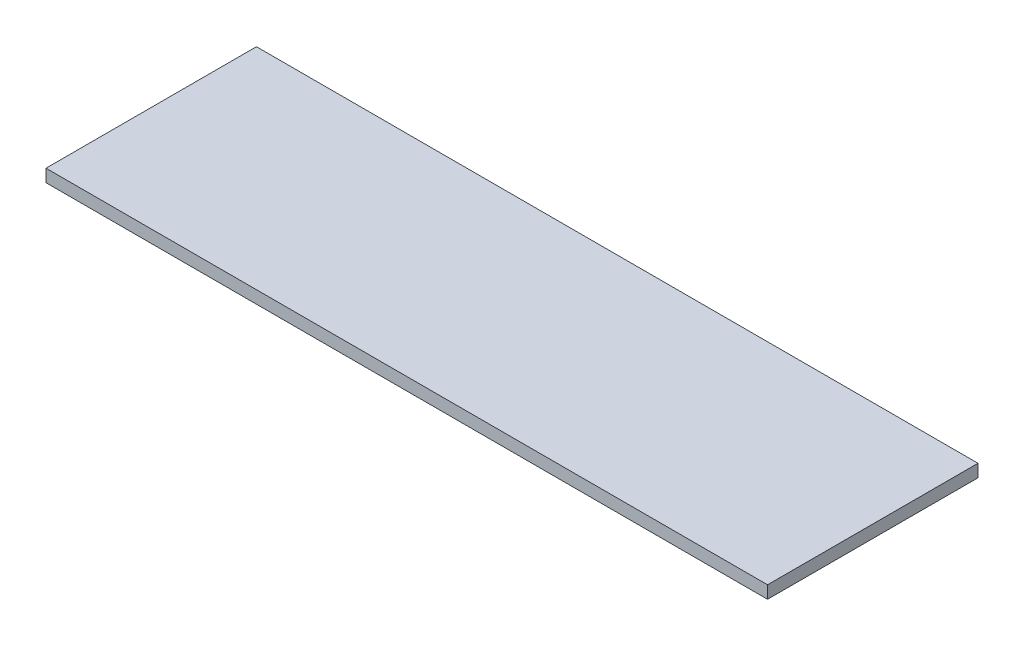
from build123d import *

# Parameters (mm, degrees)
SKETCH1_W          = 152.4
SKETCH1_H          = 44.45
F_12GA_PLATE_DEPTH = 2.65684


with BuildPart() as part:
    # Sketch1 → 12ga plate (new body)
    with BuildSketch(Plane(origin=(0, 0, 0), x_dir=(1, 0, 0), z_dir=(0, 1, 0))):
        Rectangle(SKETCH1_W, SKETCH1_H)
    extrude(amount=F_12GA_PLATE_DEPTH)


solid = part.part
